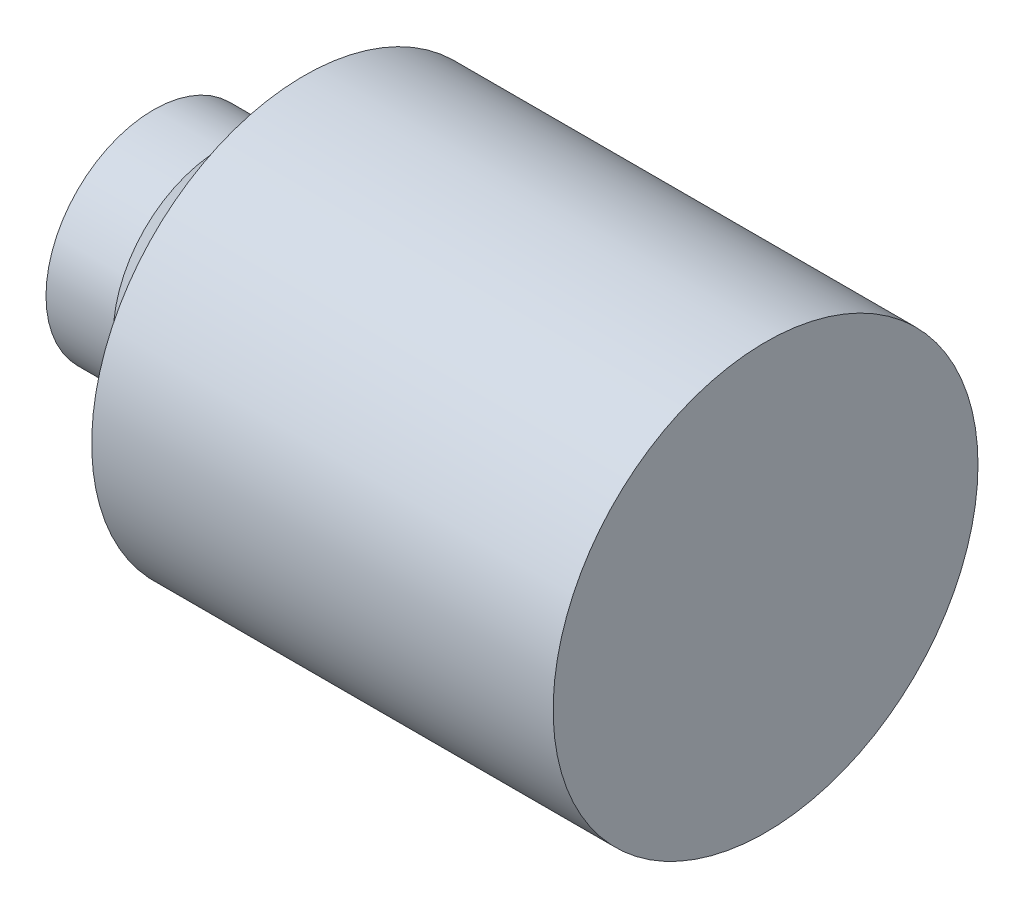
ISO-10303-21;
HEADER;
FILE_DESCRIPTION(('STEP AP214'),'2;1');
FILE_NAME('part.step','',(''),(''),'','','');
FILE_SCHEMA(('AUTOMOTIVE_DESIGN { 1 0 10303 214 1 1 1 1 }'));
ENDSEC;
DATA;
#1=APPLICATION_CONTEXT('core data for automotive mechanical design processes');
#2=APPLICATION_PROTOCOL_DEFINITION('international standard','automotive_design',2000,#1);
#3=PRODUCT_CONTEXT('',#1,'mechanical');
#4=PRODUCT('Part','Part','',(#3));
#5=PRODUCT_RELATED_PRODUCT_CATEGORY('part','',(#4));
#6=PRODUCT_DEFINITION_FORMATION('','',#4);
#7=PRODUCT_DEFINITION_CONTEXT('part definition',#1,'design');
#8=PRODUCT_DEFINITION('design','',#6,#7);
#9=PRODUCT_DEFINITION_SHAPE('','',#8);
#10=(LENGTH_UNIT() NAMED_UNIT(*) SI_UNIT(.MILLI.,.METRE.));
#11=(NAMED_UNIT(*) PLANE_ANGLE_UNIT() SI_UNIT($,.RADIAN.));
#12=(NAMED_UNIT(*) SI_UNIT($,.STERADIAN.) SOLID_ANGLE_UNIT());
#13=UNCERTAINTY_MEASURE_WITH_UNIT(LENGTH_MEASURE(1.E-05),#10,'distance_accuracy_value','');
#14=(GEOMETRIC_REPRESENTATION_CONTEXT(3) GLOBAL_UNCERTAINTY_ASSIGNED_CONTEXT((#13)) GLOBAL_UNIT_ASSIGNED_CONTEXT((#10,
#11,#12)) REPRESENTATION_CONTEXT('',''));
#15=CARTESIAN_POINT('',(0.,0.,0.));
#16=DIRECTION('',(0.,0.,1.));
#17=DIRECTION('',(1.,0.,0.));
#18=AXIS2_PLACEMENT_3D('',#15,#16,#17);
#19=CARTESIAN_POINT('',(0.,0.,0.));
#20=DIRECTION('',(1.,0.,0.));
#21=DIRECTION('',(0.,0.,-1.));
#22=AXIS2_PLACEMENT_3D('',#19,#20,#21);
#23=CYLINDRICAL_SURFACE('',#22,12.0396);
#24=CARTESIAN_POINT('',(26.6699999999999,0.,0.));
#25=DIRECTION('',(1.,0.,0.));
#26=DIRECTION('',(0.,0.,-1.));
#27=AXIS2_PLACEMENT_3D('',#24,#25,#26);
#28=CIRCLE('',#27,12.0396);
#29=CARTESIAN_POINT('',(26.6699999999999,0.,-12.0396));
#30=VERTEX_POINT('',#29);
#31=EDGE_CURVE('E71',#30,#30,#28,.T.);
#32=ORIENTED_EDGE('',*,*,#31,.T.);
#33=EDGE_LOOP('',(#32));
#34=FACE_BOUND('',#33,.T.);
#35=CARTESIAN_POINT('',(52.8238614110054,0.,0.));
#36=DIRECTION('',(1.,0.,0.));
#37=DIRECTION('',(0.,0.,-1.));
#38=AXIS2_PLACEMENT_3D('',#35,#36,#37);
#39=CIRCLE('',#38,12.0396);
#40=CARTESIAN_POINT('',(52.8238614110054,0.,-12.0396));
#41=VERTEX_POINT('',#40);
#42=EDGE_CURVE('E10',#41,#41,#39,.T.);
#43=ORIENTED_EDGE('',*,*,#42,.F.);
#44=EDGE_LOOP('',(#43));
#45=FACE_BOUND('',#44,.T.);
#46=ADVANCED_FACE('F34',(#34,#45),#23,.T.);
#47=CARTESIAN_POINT('',(52.8238614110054,12.0396,0.));
#48=DIRECTION('',(1.,0.,0.));
#49=DIRECTION('',(0.,0.,-1.));
#50=AXIS2_PLACEMENT_3D('',#47,#48,#49);
#51=PLANE('',#50);
#52=ORIENTED_EDGE('',*,*,#42,.T.);
#53=EDGE_LOOP('',(#52));
#54=FACE_BOUND('',#53,.T.);
#55=ADVANCED_FACE('F89',(#54),#51,.T.);
#56=CARTESIAN_POINT('',(50.2415406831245,0.,0.));
#57=DIRECTION('',(-1.,0.,0.));
#58=DIRECTION('',(0.,0.,1.));
#59=AXIS2_PLACEMENT_3D('',#56,#57,#58);
#60=PLANE('',#59);
#61=CARTESIAN_POINT('',(50.2415406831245,0.,0.));
#62=DIRECTION('',(1.,0.,0.));
#63=DIRECTION('',(0.,0.,-1.));
#64=AXIS2_PLACEMENT_3D('',#61,#62,#63);
#65=CIRCLE('',#64,11.);
#66=CARTESIAN_POINT('',(50.2415406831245,0.,-11.));
#67=VERTEX_POINT('',#66);
#68=EDGE_CURVE('E40',#67,#67,#65,.T.);
#69=ORIENTED_EDGE('',*,*,#68,.F.);
#70=EDGE_LOOP('',(#69));
#71=FACE_BOUND('',#70,.T.);
#72=ADVANCED_FACE('F93',(#71),#60,.T.);
#73=CARTESIAN_POINT('',(0.,0.,0.));
#74=DIRECTION('',(1.,0.,0.));
#75=DIRECTION('',(0.,0.,-1.));
#76=AXIS2_PLACEMENT_3D('',#73,#74,#75);
#77=CYLINDRICAL_SURFACE('',#76,11.);
#78=ORIENTED_EDGE('',*,*,#68,.T.);
#79=EDGE_LOOP('',(#78));
#80=FACE_BOUND('',#79,.T.);
#81=CARTESIAN_POINT('',(34.2415406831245,0.,0.));
#82=DIRECTION('',(1.,0.,0.));
#83=DIRECTION('',(0.,0.,-1.));
#84=AXIS2_PLACEMENT_3D('',#81,#82,#83);
#85=CIRCLE('',#84,11.);
#86=CARTESIAN_POINT('',(34.2415406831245,0.,-11.));
#87=VERTEX_POINT('',#86);
#88=EDGE_CURVE('E44',#87,#87,#85,.T.);
#89=ORIENTED_EDGE('',*,*,#88,.F.);
#90=EDGE_LOOP('',(#89));
#91=FACE_BOUND('',#90,.T.);
#92=ADVANCED_FACE('F97',(#80,#91),#77,.F.);
#93=CARTESIAN_POINT('',(34.2415406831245,11.,0.));
#94=DIRECTION('',(1.,0.,0.));
#95=DIRECTION('',(0.,0.,-1.));
#96=AXIS2_PLACEMENT_3D('',#93,#94,#95);
#97=PLANE('',#96);
#98=ORIENTED_EDGE('',*,*,#88,.T.);
#99=EDGE_LOOP('',(#98));
#100=FACE_BOUND('',#99,.T.);
#101=CARTESIAN_POINT('',(34.2415406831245,0.,0.));
#102=DIRECTION('',(1.,0.,0.));
#103=DIRECTION('',(0.,0.,-1.));
#104=AXIS2_PLACEMENT_3D('',#101,#102,#103);
#105=CIRCLE('',#104,5.51777702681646);
#106=CARTESIAN_POINT('',(34.2415406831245,0.,-5.51777702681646));
#107=VERTEX_POINT('',#106);
#108=EDGE_CURVE('E48',#107,#107,#105,.T.);
#109=ORIENTED_EDGE('',*,*,#108,.F.);
#110=EDGE_LOOP('',(#109));
#111=FACE_BOUND('',#110,.T.);
#112=ADVANCED_FACE('F103',(#100,#111),#97,.T.);
#113=CARTESIAN_POINT('',(0.,0.,0.));
#114=DIRECTION('',(1.,0.,0.));
#115=DIRECTION('',(0.,0.,-1.));
#116=AXIS2_PLACEMENT_3D('',#113,#114,#115);
#117=CYLINDRICAL_SURFACE('',#116,5.51777702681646);
#118=ORIENTED_EDGE('',*,*,#108,.T.);
#119=EDGE_LOOP('',(#118));
#120=FACE_BOUND('',#119,.T.);
#121=CARTESIAN_POINT('',(26.2415406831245,0.,0.));
#122=DIRECTION('',(1.,0.,0.));
#123=DIRECTION('',(0.,0.,-1.));
#124=AXIS2_PLACEMENT_3D('',#121,#122,#123);
#125=CIRCLE('',#124,5.51777702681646);
#126=CARTESIAN_POINT('',(26.2415406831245,0.,-5.51777702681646));
#127=VERTEX_POINT('',#126);
#128=EDGE_CURVE('E53',#127,#127,#125,.T.);
#129=ORIENTED_EDGE('',*,*,#128,.F.);
#130=EDGE_LOOP('',(#129));
#131=FACE_BOUND('',#130,.T.);
#132=ADVANCED_FACE('F106',(#120,#131),#117,.F.);
#133=CARTESIAN_POINT('',(26.2415406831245,5.51777702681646,0.));
#134=DIRECTION('',(1.,0.,0.));
#135=DIRECTION('',(0.,0.,-1.));
#136=AXIS2_PLACEMENT_3D('',#133,#134,#135);
#137=PLANE('',#136);
#138=ORIENTED_EDGE('',*,*,#128,.T.);
#139=EDGE_LOOP('',(#138));
#140=FACE_BOUND('',#139,.T.);
#141=CARTESIAN_POINT('',(26.2415406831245,0.,0.));
#142=DIRECTION('',(1.,0.,0.));
#143=DIRECTION('',(0.,0.,-1.));
#144=AXIS2_PLACEMENT_3D('',#141,#142,#143);
#145=CIRCLE('',#144,3.96875);
#146=CARTESIAN_POINT('',(26.2415406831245,0.,-3.96875));
#147=VERTEX_POINT('',#146);
#148=EDGE_CURVE('E56',#147,#147,#145,.T.);
#149=ORIENTED_EDGE('',*,*,#148,.F.);
#150=EDGE_LOOP('',(#149));
#151=FACE_BOUND('',#150,.T.);
#152=ADVANCED_FACE('F110',(#140,#151),#137,.T.);
#153=CARTESIAN_POINT('',(0.,0.,0.));
#154=DIRECTION('',(1.,0.,0.));
#155=DIRECTION('',(0.,0.,-1.));
#156=AXIS2_PLACEMENT_3D('',#153,#154,#155);
#157=CYLINDRICAL_SURFACE('',#156,3.96875);
#158=ORIENTED_EDGE('',*,*,#148,.T.);
#159=EDGE_LOOP('',(#158));
#160=FACE_BOUND('',#159,.T.);
#161=CARTESIAN_POINT('',(18.1356,0.,0.));
#162=DIRECTION('',(1.,0.,0.));
#163=DIRECTION('',(0.,0.,-1.));
#164=AXIS2_PLACEMENT_3D('',#161,#162,#163);
#165=CIRCLE('',#164,3.96875);
#166=CARTESIAN_POINT('',(18.1356,0.,-3.96875));
#167=VERTEX_POINT('',#166);
#168=EDGE_CURVE('E59',#167,#167,#165,.T.);
#169=ORIENTED_EDGE('',*,*,#168,.F.);
#170=EDGE_LOOP('',(#169));
#171=FACE_BOUND('',#170,.T.);
#172=ADVANCED_FACE('F114',(#160,#171),#157,.F.);
#173=CARTESIAN_POINT('',(18.1356,6.096,0.));
#174=DIRECTION('',(-1.,0.,0.));
#175=DIRECTION('',(0.,0.,1.));
#176=AXIS2_PLACEMENT_3D('',#173,#174,#175);
#177=PLANE('',#176);
#178=ORIENTED_EDGE('',*,*,#168,.T.);
#179=EDGE_LOOP('',(#178));
#180=FACE_BOUND('',#179,.T.);
#181=CARTESIAN_POINT('',(18.1356,0.,0.));
#182=DIRECTION('',(1.,0.,0.));
#183=DIRECTION('',(0.,0.,-1.));
#184=AXIS2_PLACEMENT_3D('',#181,#182,#183);
#185=CIRCLE('',#184,6.096);
#186=CARTESIAN_POINT('',(18.1356,0.,-6.096));
#187=VERTEX_POINT('',#186);
#188=EDGE_CURVE('E62',#187,#187,#185,.T.);
#189=ORIENTED_EDGE('',*,*,#188,.F.);
#190=EDGE_LOOP('',(#189));
#191=FACE_BOUND('',#190,.T.);
#192=ADVANCED_FACE('F118',(#180,#191),#177,.T.);
#193=CARTESIAN_POINT('',(0.,0.,0.));
#194=DIRECTION('',(1.,0.,0.));
#195=DIRECTION('',(0.,0.,-1.));
#196=AXIS2_PLACEMENT_3D('',#193,#194,#195);
#197=CYLINDRICAL_SURFACE('',#196,6.096);
#198=ORIENTED_EDGE('',*,*,#188,.T.);
#199=EDGE_LOOP('',(#198));
#200=FACE_BOUND('',#199,.T.);
#201=CARTESIAN_POINT('',(21.9456,0.,0.));
#202=DIRECTION('',(1.,0.,0.));
#203=DIRECTION('',(0.,0.,-1.));
#204=AXIS2_PLACEMENT_3D('',#201,#202,#203);
#205=CIRCLE('',#204,6.096);
#206=CARTESIAN_POINT('',(21.9456,0.,-6.096));
#207=VERTEX_POINT('',#206);
#208=EDGE_CURVE('E65',#207,#207,#205,.T.);
#209=ORIENTED_EDGE('',*,*,#208,.F.);
#210=EDGE_LOOP('',(#209));
#211=FACE_BOUND('',#210,.T.);
#212=ADVANCED_FACE('F85',(#200,#211),#197,.T.);
#213=CARTESIAN_POINT('',(26.6699999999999,0.,0.));
#214=DIRECTION('',(1.,0.,0.));
#215=DIRECTION('',(0.,0.,-1.));
#216=AXIS2_PLACEMENT_3D('',#213,#214,#215);
#217=CONICAL_SURFACE('',#216,10.8203999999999,0.785398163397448);
#218=ORIENTED_EDGE('',*,*,#208,.T.);
#219=EDGE_LOOP('',(#218));
#220=FACE_BOUND('',#219,.T.);
#221=CARTESIAN_POINT('',(26.6699999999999,0.,0.));
#222=DIRECTION('',(1.,0.,0.));
#223=DIRECTION('',(0.,0.,-1.));
#224=AXIS2_PLACEMENT_3D('',#221,#222,#223);
#225=CIRCLE('',#224,10.8203999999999);
#226=CARTESIAN_POINT('',(26.6699999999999,0.,-10.8203999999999));
#227=VERTEX_POINT('',#226);
#228=EDGE_CURVE('E68',#227,#227,#225,.T.);
#229=ORIENTED_EDGE('',*,*,#228,.F.);
#230=EDGE_LOOP('',(#229));
#231=FACE_BOUND('',#230,.T.);
#232=ADVANCED_FACE('F79',(#220,#231),#217,.T.);
#233=CARTESIAN_POINT('',(26.6699999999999,10.8203999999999,0.));
#234=DIRECTION('',(-1.,0.,0.));
#235=DIRECTION('',(0.,0.,1.));
#236=AXIS2_PLACEMENT_3D('',#233,#234,#235);
#237=PLANE('',#236);
#238=ORIENTED_EDGE('',*,*,#228,.T.);
#239=EDGE_LOOP('',(#238));
#240=FACE_BOUND('',#239,.T.);
#241=ORIENTED_EDGE('',*,*,#31,.F.);
#242=EDGE_LOOP('',(#241));
#243=FACE_BOUND('',#242,.T.);
#244=ADVANCED_FACE('F77',(#240,#243),#237,.T.);
#245=CLOSED_SHELL('',(#46,#55,#72,#92,#112,#132,#152,#172,#192,#212,#232,#244));
#246=MANIFOLD_SOLID_BREP('B2',#245);
#247=ADVANCED_BREP_SHAPE_REPRESENTATION('',(#18,#246),#14);
#248=SHAPE_DEFINITION_REPRESENTATION(#9,#247);
ENDSEC;
END-ISO-10303-21;
